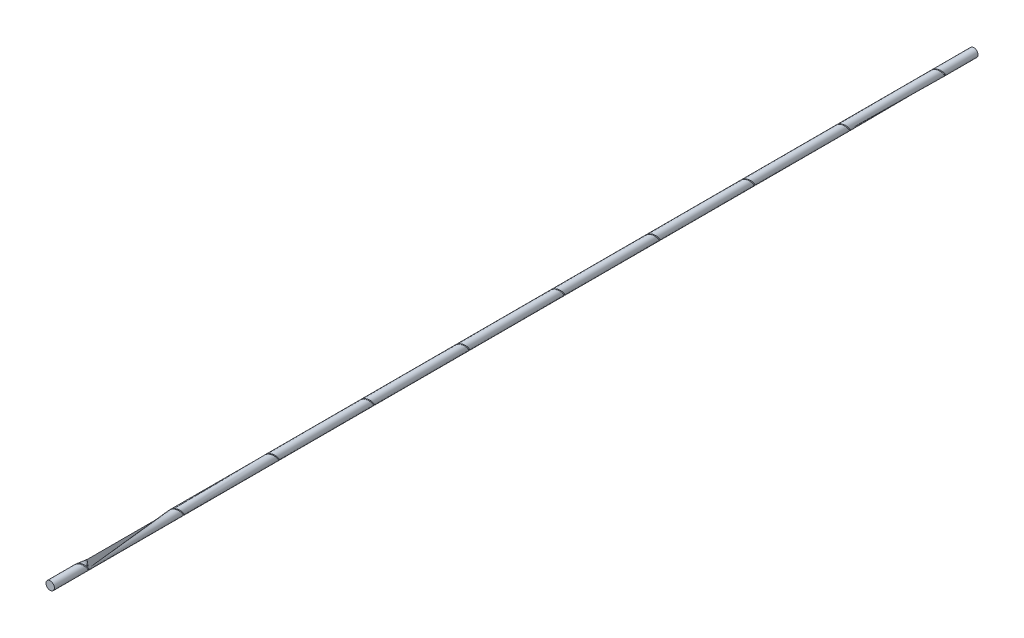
from build123d import *

# Parameters (mm, degrees)
SKETCH1_R              = 25
BOSS_EXTRUDE1_DEPTH    = 5500
CUT_SWEEP1_PITCH       = 100
CUT_SWEEP1_HEIGHT      = 100
CUT_SWEEP1_RADIUS      = 27.646
CUT_SWEEP1_START_ANGLE = -180
SKETCH3_R              = 3.969
LPATTERN1_COUNT        = 10
LPATTERN1_PITCH        = 566.666666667


with BuildPart() as part:
    # Sketch1 → Boss-Extrude1 (new body)
    with BuildSketch(Plane.XY):
        Circle(SKETCH1_R)
    extrude(amount=BOSS_EXTRUDE1_DEPTH)

    # Cut-Sweep1: sweep along a helix
    with BuildLine() as cut_sweep1_path:
        add(Helix(CUT_SWEEP1_PITCH, CUT_SWEEP1_HEIGHT, CUT_SWEEP1_RADIUS, center=(0, 0, 150), direction=(0, 0, 1), mode=Mode.PRIVATE).rotate(Axis((0, 0, 150), (0, 0, 1)), CUT_SWEEP1_START_ANGLE))
    # Sketch3 → Cut-Sweep1 (sweep, cut)
    with BuildSketch(Plane(origin=(0, 0, 0), x_dir=(1, 0, 0), z_dir=(0, 1, 0))):
        with Locations((-27.646, -150)):
            Circle(SKETCH3_R)
    cut_sweep1 = sweep(path=cut_sweep1_path.line, is_frenet=True, mode=Mode.SUBTRACT)

    # LPattern1: Cut-Sweep1 ×10
    with Locations(*[(0, 0, i * LPATTERN1_PITCH) for i in range(1, LPATTERN1_COUNT)]):
        add(cut_sweep1, mode=Mode.SUBTRACT)


solid = part.part
